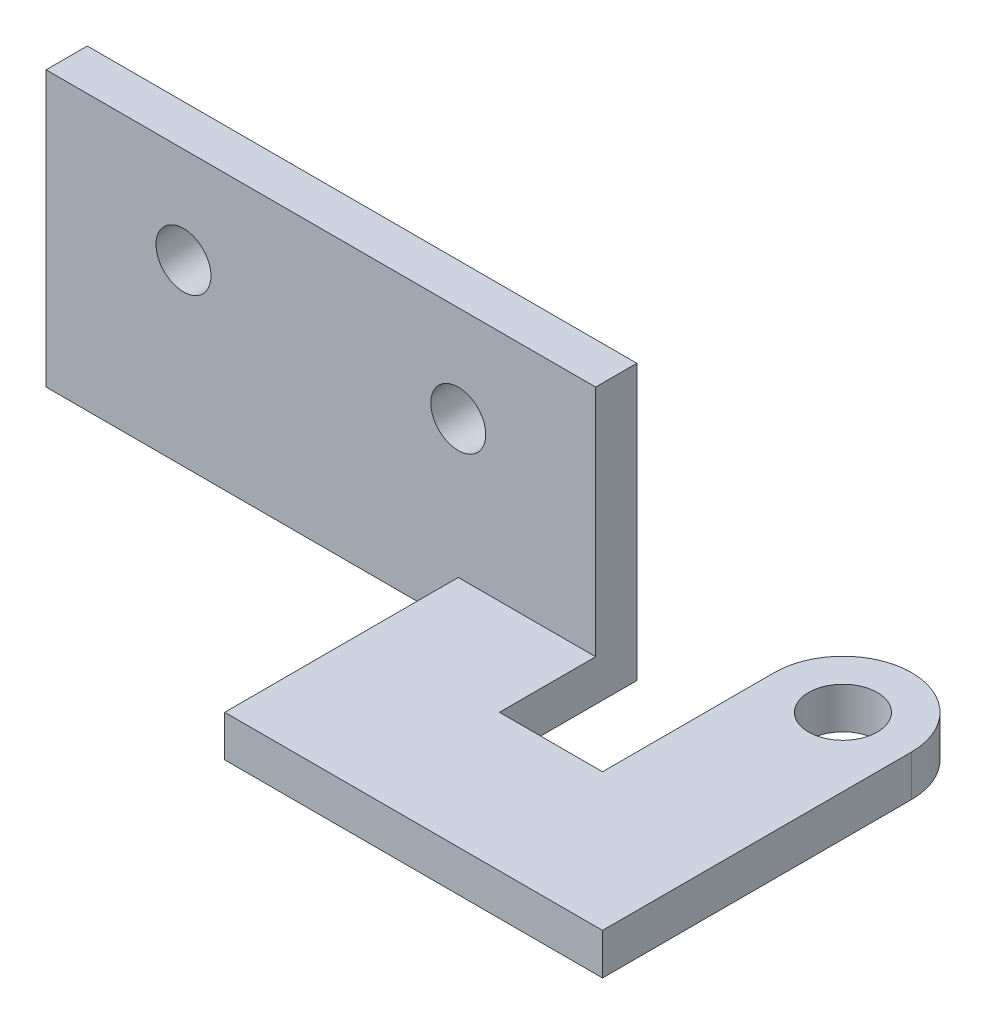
ISO-10303-21;
HEADER;
FILE_DESCRIPTION(('STEP AP214'),'2;1');
FILE_NAME('part.step','',(''),(''),'','','');
FILE_SCHEMA(('AUTOMOTIVE_DESIGN { 1 0 10303 214 1 1 1 1 }'));
ENDSEC;
DATA;
#1=APPLICATION_CONTEXT('core data for automotive mechanical design processes');
#2=APPLICATION_PROTOCOL_DEFINITION('international standard','automotive_design',2000,#1);
#3=PRODUCT_CONTEXT('',#1,'mechanical');
#4=PRODUCT('Part','Part','',(#3));
#5=PRODUCT_RELATED_PRODUCT_CATEGORY('part','',(#4));
#6=PRODUCT_DEFINITION_FORMATION('','',#4);
#7=PRODUCT_DEFINITION_CONTEXT('part definition',#1,'design');
#8=PRODUCT_DEFINITION('design','',#6,#7);
#9=PRODUCT_DEFINITION_SHAPE('','',#8);
#10=(LENGTH_UNIT() NAMED_UNIT(*) SI_UNIT(.MILLI.,.METRE.));
#11=(NAMED_UNIT(*) PLANE_ANGLE_UNIT() SI_UNIT($,.RADIAN.));
#12=(NAMED_UNIT(*) SI_UNIT($,.STERADIAN.) SOLID_ANGLE_UNIT());
#13=UNCERTAINTY_MEASURE_WITH_UNIT(LENGTH_MEASURE(1.E-05),#10,'distance_accuracy_value','');
#14=(GEOMETRIC_REPRESENTATION_CONTEXT(3) GLOBAL_UNCERTAINTY_ASSIGNED_CONTEXT((#13)) GLOBAL_UNIT_ASSIGNED_CONTEXT((#10,
#11,#12)) REPRESENTATION_CONTEXT('',''));
#15=CARTESIAN_POINT('',(0.,0.,0.));
#16=DIRECTION('',(0.,0.,1.));
#17=DIRECTION('',(1.,0.,0.));
#18=AXIS2_PLACEMENT_3D('',#15,#16,#17);
#19=CARTESIAN_POINT('',(0.,20.,3.));
#20=DIRECTION('',(0.,0.,-1.));
#21=DIRECTION('',(-1.,0.,0.));
#22=AXIS2_PLACEMENT_3D('',#19,#20,#21);
#23=PLANE('',#22);
#24=CARTESIAN_POINT('',(10.,13.,3.));
#25=DIRECTION('',(0.,0.,1.));
#26=DIRECTION('',(1.,0.,0.));
#27=AXIS2_PLACEMENT_3D('',#24,#25,#26);
#28=CIRCLE('',#27,2.);
#29=CARTESIAN_POINT('',(12.,13.,3.));
#30=VERTEX_POINT('',#29);
#31=EDGE_CURVE('E181',#30,#30,#28,.T.);
#32=ORIENTED_EDGE('',*,*,#31,.F.);
#33=EDGE_LOOP('',(#32));
#34=FACE_BOUND('',#33,.T.);
#35=DIRECTION('',(1.,0.,0.));
#36=VECTOR('',#35,1.);
#37=CARTESIAN_POINT('',(0.,0.,3.));
#38=LINE('',#37,#36);
#39=CARTESIAN_POINT('',(0.,0.,3.));
#40=VERTEX_POINT('',#39);
#41=CARTESIAN_POINT('',(30.,0.,3.));
#42=VERTEX_POINT('',#41);
#43=EDGE_CURVE('E190',#40,#42,#38,.T.);
#44=ORIENTED_EDGE('',*,*,#43,.T.);
#45=DIRECTION('',(0.,1.,0.));
#46=VECTOR('',#45,1.);
#47=CARTESIAN_POINT('',(30.,20.,3.));
#48=LINE('',#47,#46);
#49=CARTESIAN_POINT('',(30.,3.,3.));
#50=VERTEX_POINT('',#49);
#51=EDGE_CURVE('E172',#42,#50,#48,.T.);
#52=ORIENTED_EDGE('',*,*,#51,.T.);
#53=DIRECTION('',(-1.,0.,0.));
#54=VECTOR('',#53,1.);
#55=CARTESIAN_POINT('',(0.,3.,3.));
#56=LINE('',#55,#54);
#57=CARTESIAN_POINT('',(40.,3.,3.));
#58=VERTEX_POINT('',#57);
#59=EDGE_CURVE('E166',#58,#50,#56,.T.);
#60=ORIENTED_EDGE('',*,*,#59,.F.);
#61=DIRECTION('',(0.,1.,0.));
#62=VECTOR('',#61,1.);
#63=CARTESIAN_POINT('',(40.,0.,3.));
#64=LINE('',#63,#62);
#65=CARTESIAN_POINT('',(40.,20.,3.));
#66=VERTEX_POINT('',#65);
#67=EDGE_CURVE('E125',#58,#66,#64,.T.);
#68=ORIENTED_EDGE('',*,*,#67,.T.);
#69=DIRECTION('',(-1.,0.,0.));
#70=VECTOR('',#69,1.);
#71=CARTESIAN_POINT('',(0.,20.,3.));
#72=LINE('',#71,#70);
#73=CARTESIAN_POINT('',(0.,20.,3.));
#74=VERTEX_POINT('',#73);
#75=EDGE_CURVE('E194',#66,#74,#72,.T.);
#76=ORIENTED_EDGE('',*,*,#75,.T.);
#77=DIRECTION('',(0.,-1.,0.));
#78=VECTOR('',#77,1.);
#79=CARTESIAN_POINT('',(0.,0.,3.));
#80=LINE('',#79,#78);
#81=EDGE_CURVE('E187',#74,#40,#80,.T.);
#82=ORIENTED_EDGE('',*,*,#81,.T.);
#83=EDGE_LOOP('',(#44,#52,#60,#68,#76,#82));
#84=FACE_BOUND('',#83,.T.);
#85=CARTESIAN_POINT('',(30.,13.,3.));
#86=DIRECTION('',(0.,0.,1.));
#87=DIRECTION('',(1.,0.,0.));
#88=AXIS2_PLACEMENT_3D('',#85,#86,#87);
#89=CIRCLE('',#88,2.);
#90=CARTESIAN_POINT('',(32.,13.,3.));
#91=VERTEX_POINT('',#90);
#92=EDGE_CURVE('E175',#91,#91,#89,.T.);
#93=ORIENTED_EDGE('',*,*,#92,.F.);
#94=EDGE_LOOP('',(#93));
#95=FACE_BOUND('',#94,.T.);
#96=ADVANCED_FACE('F30',(#34,#84,#95),#23,.F.);
#97=CARTESIAN_POINT('',(0.,20.,0.));
#98=DIRECTION('',(0.,0.,-1.));
#99=DIRECTION('',(-1.,0.,0.));
#100=AXIS2_PLACEMENT_3D('',#97,#98,#99);
#101=PLANE('',#100);
#102=DIRECTION('',(0.,1.,0.));
#103=VECTOR('',#102,1.);
#104=CARTESIAN_POINT('',(40.,0.,0.));
#105=LINE('',#104,#103);
#106=CARTESIAN_POINT('',(40.,0.,0.));
#107=VERTEX_POINT('',#106);
#108=CARTESIAN_POINT('',(40.,20.,0.));
#109=VERTEX_POINT('',#108);
#110=EDGE_CURVE('E201',#107,#109,#105,.T.);
#111=ORIENTED_EDGE('',*,*,#110,.F.);
#112=DIRECTION('',(1.,0.,0.));
#113=VECTOR('',#112,1.);
#114=CARTESIAN_POINT('',(0.,0.,0.));
#115=LINE('',#114,#113);
#116=CARTESIAN_POINT('',(0.,0.,0.));
#117=VERTEX_POINT('',#116);
#118=EDGE_CURVE('E199',#117,#107,#115,.T.);
#119=ORIENTED_EDGE('',*,*,#118,.F.);
#120=DIRECTION('',(0.,-1.,0.));
#121=VECTOR('',#120,1.);
#122=CARTESIAN_POINT('',(0.,0.,0.));
#123=LINE('',#122,#121);
#124=CARTESIAN_POINT('',(0.,20.,0.));
#125=VERTEX_POINT('',#124);
#126=EDGE_CURVE('E184',#125,#117,#123,.T.);
#127=ORIENTED_EDGE('',*,*,#126,.F.);
#128=DIRECTION('',(-1.,0.,0.));
#129=VECTOR('',#128,1.);
#130=CARTESIAN_POINT('',(0.,20.,0.));
#131=LINE('',#130,#129);
#132=EDGE_CURVE('E191',#109,#125,#131,.T.);
#133=ORIENTED_EDGE('',*,*,#132,.F.);
#134=EDGE_LOOP('',(#111,#119,#127,#133));
#135=FACE_BOUND('',#134,.T.);
#136=CARTESIAN_POINT('',(10.,13.,0.));
#137=DIRECTION('',(0.,0.,1.));
#138=DIRECTION('',(1.,0.,0.));
#139=AXIS2_PLACEMENT_3D('',#136,#137,#138);
#140=CIRCLE('',#139,2.);
#141=CARTESIAN_POINT('',(12.,13.,0.));
#142=VERTEX_POINT('',#141);
#143=EDGE_CURVE('E178',#142,#142,#140,.T.);
#144=ORIENTED_EDGE('',*,*,#143,.T.);
#145=EDGE_LOOP('',(#144));
#146=FACE_BOUND('',#145,.T.);
#147=CARTESIAN_POINT('',(30.,13.,0.));
#148=DIRECTION('',(0.,0.,1.));
#149=DIRECTION('',(1.,0.,0.));
#150=AXIS2_PLACEMENT_3D('',#147,#148,#149);
#151=CIRCLE('',#150,2.);
#152=CARTESIAN_POINT('',(32.,13.,0.));
#153=VERTEX_POINT('',#152);
#154=EDGE_CURVE('E174',#153,#153,#151,.T.);
#155=ORIENTED_EDGE('',*,*,#154,.T.);
#156=EDGE_LOOP('',(#155));
#157=FACE_BOUND('',#156,.T.);
#158=ADVANCED_FACE('F252',(#135,#146,#157),#101,.T.);
#159=CARTESIAN_POINT('',(0.,0.,3.));
#160=DIRECTION('',(1.,0.,0.));
#161=DIRECTION('',(0.,0.,-1.));
#162=AXIS2_PLACEMENT_3D('',#159,#160,#161);
#163=PLANE('',#162);
#164=ORIENTED_EDGE('',*,*,#126,.T.);
#165=DIRECTION('',(0.,0.,-1.));
#166=VECTOR('',#165,1.);
#167=CARTESIAN_POINT('',(0.,0.,3.));
#168=LINE('',#167,#166);
#169=EDGE_CURVE('E211',#40,#117,#168,.T.);
#170=ORIENTED_EDGE('',*,*,#169,.F.);
#171=ORIENTED_EDGE('',*,*,#81,.F.);
#172=DIRECTION('',(0.,0.,-1.));
#173=VECTOR('',#172,1.);
#174=CARTESIAN_POINT('',(0.,20.,3.));
#175=LINE('',#174,#173);
#176=EDGE_CURVE('E196',#74,#125,#175,.T.);
#177=ORIENTED_EDGE('',*,*,#176,.T.);
#178=EDGE_LOOP('',(#164,#170,#171,#177));
#179=FACE_BOUND('',#178,.T.);
#180=ADVANCED_FACE('F247',(#179),#163,.F.);
#181=CARTESIAN_POINT('',(0.,0.,3.));
#182=DIRECTION('',(0.,1.,0.));
#183=DIRECTION('',(0.,0.,1.));
#184=AXIS2_PLACEMENT_3D('',#181,#182,#183);
#185=PLANE('',#184);
#186=CARTESIAN_POINT('',(52.5,0.,-2.5));
#187=DIRECTION('',(0.,1.,0.));
#188=DIRECTION('',(0.,0.,1.));
#189=AXIS2_PLACEMENT_3D('',#186,#187,#188);
#190=CIRCLE('',#189,5.);
#191=CARTESIAN_POINT('',(47.5,0.,-2.5));
#192=VERTEX_POINT('',#191);
#193=CARTESIAN_POINT('',(52.5,0.,-7.5));
#194=VERTEX_POINT('',#193);
#195=EDGE_CURVE('E214',#192,#194,#190,.F.);
#196=ORIENTED_EDGE('',*,*,#195,.T.);
#197=CARTESIAN_POINT('',(52.5,0.,-2.5));
#198=DIRECTION('',(0.,1.,0.));
#199=DIRECTION('',(0.,0.,1.));
#200=AXIS2_PLACEMENT_3D('',#197,#198,#199);
#201=CIRCLE('',#200,5.);
#202=CARTESIAN_POINT('',(57.5,0.,-2.5));
#203=VERTEX_POINT('',#202);
#204=EDGE_CURVE('E216',#194,#203,#201,.F.);
#205=ORIENTED_EDGE('',*,*,#204,.T.);
#206=DIRECTION('',(0.,0.,1.));
#207=VECTOR('',#206,1.);
#208=CARTESIAN_POINT('',(57.5,0.,-7.5));
#209=LINE('',#208,#207);
#210=CARTESIAN_POINT('',(57.5,0.,20.));
#211=VERTEX_POINT('',#210);
#212=EDGE_CURVE('E157',#203,#211,#209,.T.);
#213=ORIENTED_EDGE('',*,*,#212,.T.);
#214=DIRECTION('',(-1.,0.,0.));
#215=VECTOR('',#214,1.);
#216=CARTESIAN_POINT('',(57.5,0.,20.));
#217=LINE('',#216,#215);
#218=CARTESIAN_POINT('',(30.,0.,20.));
#219=VERTEX_POINT('',#218);
#220=EDGE_CURVE('E159',#211,#219,#217,.T.);
#221=ORIENTED_EDGE('',*,*,#220,.T.);
#222=DIRECTION('',(0.,0.,-1.));
#223=VECTOR('',#222,1.);
#224=CARTESIAN_POINT('',(30.,0.,20.));
#225=LINE('',#224,#223);
#226=EDGE_CURVE('E129',#219,#42,#225,.T.);
#227=ORIENTED_EDGE('',*,*,#226,.T.);
#228=ORIENTED_EDGE('',*,*,#43,.F.);
#229=ORIENTED_EDGE('',*,*,#169,.T.);
#230=ORIENTED_EDGE('',*,*,#118,.T.);
#231=DIRECTION('',(0.,0.,-1.));
#232=VECTOR('',#231,1.);
#233=CARTESIAN_POINT('',(40.,0.,3.));
#234=LINE('',#233,#232);
#235=CARTESIAN_POINT('',(40.,0.,10.));
#236=VERTEX_POINT('',#235);
#237=EDGE_CURVE('E209',#236,#107,#234,.T.);
#238=ORIENTED_EDGE('',*,*,#237,.F.);
#239=DIRECTION('',(1.,0.,0.));
#240=VECTOR('',#239,1.);
#241=CARTESIAN_POINT('',(40.,0.,10.));
#242=LINE('',#241,#240);
#243=CARTESIAN_POINT('',(47.5,0.,10.));
#244=VERTEX_POINT('',#243);
#245=EDGE_CURVE('E135',#236,#244,#242,.T.);
#246=ORIENTED_EDGE('',*,*,#245,.T.);
#247=DIRECTION('',(0.,0.,-1.));
#248=VECTOR('',#247,1.);
#249=CARTESIAN_POINT('',(47.5,0.,10.));
#250=LINE('',#249,#248);
#251=EDGE_CURVE('E153',#244,#192,#250,.T.);
#252=ORIENTED_EDGE('',*,*,#251,.T.);
#253=EDGE_LOOP('',(#196,#205,#213,#221,#227,#228,#229,#230,#238,#246,#252));
#254=FACE_BOUND('',#253,.T.);
#255=CARTESIAN_POINT('',(52.5,0.,-2.5));
#256=DIRECTION('',(0.,-1.,0.));
#257=DIRECTION('',(0.,0.,-1.));
#258=AXIS2_PLACEMENT_3D('',#255,#256,#257);
#259=CIRCLE('',#258,2.50000000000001);
#260=CARTESIAN_POINT('',(52.5,0.,-5.));
#261=VERTEX_POINT('',#260);
#262=EDGE_CURVE('E308',#261,#261,#259,.T.);
#263=ORIENTED_EDGE('',*,*,#262,.F.);
#264=EDGE_LOOP('',(#263));
#265=FACE_BOUND('',#264,.T.);
#266=ADVANCED_FACE('F236',(#254,#265),#185,.F.);
#267=CARTESIAN_POINT('',(40.,0.,3.));
#268=DIRECTION('',(-1.,0.,0.));
#269=DIRECTION('',(0.,0.,1.));
#270=AXIS2_PLACEMENT_3D('',#267,#268,#269);
#271=PLANE('',#270);
#272=ORIENTED_EDGE('',*,*,#110,.T.);
#273=DIRECTION('',(0.,0.,-1.));
#274=VECTOR('',#273,1.);
#275=CARTESIAN_POINT('',(40.,20.,3.));
#276=LINE('',#275,#274);
#277=EDGE_CURVE('E206',#66,#109,#276,.T.);
#278=ORIENTED_EDGE('',*,*,#277,.F.);
#279=ORIENTED_EDGE('',*,*,#67,.F.);
#280=DIRECTION('',(0.,0.,1.));
#281=VECTOR('',#280,1.);
#282=CARTESIAN_POINT('',(40.,3.,0.));
#283=LINE('',#282,#281);
#284=CARTESIAN_POINT('',(40.,3.,10.));
#285=VERTEX_POINT('',#284);
#286=EDGE_CURVE('E118',#58,#285,#283,.T.);
#287=ORIENTED_EDGE('',*,*,#286,.T.);
#288=DIRECTION('',(0.,-1.,0.));
#289=VECTOR('',#288,1.);
#290=CARTESIAN_POINT('',(40.,3.,10.));
#291=LINE('',#290,#289);
#292=EDGE_CURVE('E122',#285,#236,#291,.T.);
#293=ORIENTED_EDGE('',*,*,#292,.T.);
#294=ORIENTED_EDGE('',*,*,#237,.T.);
#295=EDGE_LOOP('',(#272,#278,#279,#287,#293,#294));
#296=FACE_BOUND('',#295,.T.);
#297=ADVANCED_FACE('F120',(#296),#271,.F.);
#298=CARTESIAN_POINT('',(0.,20.,3.));
#299=DIRECTION('',(0.,-1.,0.));
#300=DIRECTION('',(0.,0.,-1.));
#301=AXIS2_PLACEMENT_3D('',#298,#299,#300);
#302=PLANE('',#301);
#303=ORIENTED_EDGE('',*,*,#132,.T.);
#304=ORIENTED_EDGE('',*,*,#176,.F.);
#305=ORIENTED_EDGE('',*,*,#75,.F.);
#306=ORIENTED_EDGE('',*,*,#277,.T.);
#307=EDGE_LOOP('',(#303,#304,#305,#306));
#308=FACE_BOUND('',#307,.T.);
#309=ADVANCED_FACE('F256',(#308),#302,.F.);
#310=CARTESIAN_POINT('',(10.,13.,3.));
#311=DIRECTION('',(0.,0.,-1.));
#312=DIRECTION('',(-1.,0.,0.));
#313=AXIS2_PLACEMENT_3D('',#310,#311,#312);
#314=CYLINDRICAL_SURFACE('',#313,2.);
#315=ORIENTED_EDGE('',*,*,#31,.T.);
#316=EDGE_LOOP('',(#315));
#317=FACE_BOUND('',#316,.T.);
#318=ORIENTED_EDGE('',*,*,#143,.F.);
#319=EDGE_LOOP('',(#318));
#320=FACE_BOUND('',#319,.T.);
#321=ADVANCED_FACE('F258',(#317,#320),#314,.F.);
#322=CARTESIAN_POINT('',(30.,13.,3.));
#323=DIRECTION('',(0.,0.,-1.));
#324=DIRECTION('',(-1.,0.,0.));
#325=AXIS2_PLACEMENT_3D('',#322,#323,#324);
#326=CYLINDRICAL_SURFACE('',#325,2.);
#327=ORIENTED_EDGE('',*,*,#92,.T.);
#328=EDGE_LOOP('',(#327));
#329=FACE_BOUND('',#328,.T.);
#330=ORIENTED_EDGE('',*,*,#154,.F.);
#331=EDGE_LOOP('',(#330));
#332=FACE_BOUND('',#331,.T.);
#333=ADVANCED_FACE('F264',(#329,#332),#326,.F.);
#334=CARTESIAN_POINT('',(30.,3.,20.));
#335=DIRECTION('',(-1.,0.,0.));
#336=DIRECTION('',(0.,0.,1.));
#337=AXIS2_PLACEMENT_3D('',#334,#335,#336);
#338=PLANE('',#337);
#339=ORIENTED_EDGE('',*,*,#51,.F.);
#340=ORIENTED_EDGE('',*,*,#226,.F.);
#341=DIRECTION('',(0.,-1.,0.));
#342=VECTOR('',#341,1.);
#343=CARTESIAN_POINT('',(30.,3.,20.));
#344=LINE('',#343,#342);
#345=CARTESIAN_POINT('',(30.,3.,20.));
#346=VERTEX_POINT('',#345);
#347=EDGE_CURVE('E164',#346,#219,#344,.T.);
#348=ORIENTED_EDGE('',*,*,#347,.F.);
#349=DIRECTION('',(0.,0.,-1.));
#350=VECTOR('',#349,1.);
#351=CARTESIAN_POINT('',(30.,3.,20.));
#352=LINE('',#351,#350);
#353=EDGE_CURVE('E137',#346,#50,#352,.T.);
#354=ORIENTED_EDGE('',*,*,#353,.T.);
#355=EDGE_LOOP('',(#339,#340,#348,#354));
#356=FACE_BOUND('',#355,.T.);
#357=ADVANCED_FACE('F240',(#356),#338,.T.);
#358=CARTESIAN_POINT('',(40.,3.,0.));
#359=DIRECTION('',(0.,-1.,0.));
#360=DIRECTION('',(0.,0.,-1.));
#361=AXIS2_PLACEMENT_3D('',#358,#359,#360);
#362=PLANE('',#361);
#363=CARTESIAN_POINT('',(52.5,3.,-2.5));
#364=DIRECTION('',(0.,-1.,0.));
#365=DIRECTION('',(0.,0.,-1.));
#366=AXIS2_PLACEMENT_3D('',#363,#364,#365);
#367=CIRCLE('',#366,2.50000000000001);
#368=CARTESIAN_POINT('',(52.5,3.,-5.));
#369=VERTEX_POINT('',#368);
#370=EDGE_CURVE('E154',#369,#369,#367,.T.);
#371=ORIENTED_EDGE('',*,*,#370,.T.);
#372=EDGE_LOOP('',(#371));
#373=FACE_BOUND('',#372,.T.);
#374=DIRECTION('',(0.,0.,1.));
#375=VECTOR('',#374,1.);
#376=CARTESIAN_POINT('',(57.5,3.,-7.5));
#377=LINE('',#376,#375);
#378=CARTESIAN_POINT('',(57.5,3.,-2.5));
#379=VERTEX_POINT('',#378);
#380=CARTESIAN_POINT('',(57.5,3.,20.));
#381=VERTEX_POINT('',#380);
#382=EDGE_CURVE('E142',#379,#381,#377,.T.);
#383=ORIENTED_EDGE('',*,*,#382,.F.);
#384=CARTESIAN_POINT('',(52.5,3.,-2.5));
#385=DIRECTION('',(0.,-1.,0.));
#386=DIRECTION('',(0.,0.,-1.));
#387=AXIS2_PLACEMENT_3D('',#384,#385,#386);
#388=CIRCLE('',#387,5.);
#389=CARTESIAN_POINT('',(52.5,3.,-7.5));
#390=VERTEX_POINT('',#389);
#391=EDGE_CURVE('E39',#379,#390,#388,.F.);
#392=ORIENTED_EDGE('',*,*,#391,.T.);
#393=CARTESIAN_POINT('',(52.5,3.,-2.5));
#394=DIRECTION('',(0.,-1.,0.));
#395=DIRECTION('',(0.,0.,-1.));
#396=AXIS2_PLACEMENT_3D('',#393,#394,#395);
#397=CIRCLE('',#396,5.);
#398=CARTESIAN_POINT('',(47.5,3.,-2.5));
#399=VERTEX_POINT('',#398);
#400=EDGE_CURVE('E46',#390,#399,#397,.F.);
#401=ORIENTED_EDGE('',*,*,#400,.T.);
#402=DIRECTION('',(0.,0.,-1.));
#403=VECTOR('',#402,1.);
#404=CARTESIAN_POINT('',(47.5,3.,10.));
#405=LINE('',#404,#403);
#406=CARTESIAN_POINT('',(47.5,3.,10.));
#407=VERTEX_POINT('',#406);
#408=EDGE_CURVE('E140',#407,#399,#405,.T.);
#409=ORIENTED_EDGE('',*,*,#408,.F.);
#410=DIRECTION('',(1.,0.,0.));
#411=VECTOR('',#410,1.);
#412=CARTESIAN_POINT('',(40.,3.,10.));
#413=LINE('',#412,#411);
#414=EDGE_CURVE('E128',#285,#407,#413,.T.);
#415=ORIENTED_EDGE('',*,*,#414,.F.);
#416=ORIENTED_EDGE('',*,*,#286,.F.);
#417=ORIENTED_EDGE('',*,*,#59,.T.);
#418=ORIENTED_EDGE('',*,*,#353,.F.);
#419=DIRECTION('',(-1.,0.,0.));
#420=VECTOR('',#419,1.);
#421=CARTESIAN_POINT('',(57.5,3.,20.));
#422=LINE('',#421,#420);
#423=EDGE_CURVE('E147',#381,#346,#422,.T.);
#424=ORIENTED_EDGE('',*,*,#423,.F.);
#425=EDGE_LOOP('',(#383,#392,#401,#409,#415,#416,#417,#418,#424));
#426=FACE_BOUND('',#425,.T.);
#427=ADVANCED_FACE('F139',(#373,#426),#362,.F.);
#428=CARTESIAN_POINT('',(57.5,3.,20.));
#429=DIRECTION('',(0.,0.,1.));
#430=DIRECTION('',(1.,0.,0.));
#431=AXIS2_PLACEMENT_3D('',#428,#429,#430);
#432=PLANE('',#431);
#433=ORIENTED_EDGE('',*,*,#220,.F.);
#434=DIRECTION('',(0.,-1.,0.));
#435=VECTOR('',#434,1.);
#436=CARTESIAN_POINT('',(57.5,3.,20.));
#437=LINE('',#436,#435);
#438=EDGE_CURVE('E167',#381,#211,#437,.T.);
#439=ORIENTED_EDGE('',*,*,#438,.F.);
#440=ORIENTED_EDGE('',*,*,#423,.T.);
#441=ORIENTED_EDGE('',*,*,#347,.T.);
#442=EDGE_LOOP('',(#433,#439,#440,#441));
#443=FACE_BOUND('',#442,.T.);
#444=ADVANCED_FACE('F233',(#443),#432,.T.);
#445=CARTESIAN_POINT('',(57.5,3.,-7.5));
#446=DIRECTION('',(1.,0.,0.));
#447=DIRECTION('',(0.,0.,-1.));
#448=AXIS2_PLACEMENT_3D('',#445,#446,#447);
#449=PLANE('',#448);
#450=ORIENTED_EDGE('',*,*,#212,.F.);
#451=DIRECTION('',(0.,-1.,0.));
#452=VECTOR('',#451,1.);
#453=CARTESIAN_POINT('',(57.5,3.,-2.5));
#454=LINE('',#453,#452);
#455=EDGE_CURVE('E218',#203,#379,#454,.F.);
#456=ORIENTED_EDGE('',*,*,#455,.T.);
#457=ORIENTED_EDGE('',*,*,#382,.T.);
#458=ORIENTED_EDGE('',*,*,#438,.T.);
#459=EDGE_LOOP('',(#450,#456,#457,#458));
#460=FACE_BOUND('',#459,.T.);
#461=ADVANCED_FACE('F225',(#460),#449,.T.);
#462=CARTESIAN_POINT('',(47.5,3.,10.));
#463=DIRECTION('',(-1.,0.,0.));
#464=DIRECTION('',(0.,0.,1.));
#465=AXIS2_PLACEMENT_3D('',#462,#463,#464);
#466=PLANE('',#465);
#467=ORIENTED_EDGE('',*,*,#408,.T.);
#468=DIRECTION('',(0.,-1.,0.));
#469=VECTOR('',#468,1.);
#470=CARTESIAN_POINT('',(47.5,3.,-2.5));
#471=LINE('',#470,#469);
#472=EDGE_CURVE('E11',#399,#192,#471,.T.);
#473=ORIENTED_EDGE('',*,*,#472,.T.);
#474=ORIENTED_EDGE('',*,*,#251,.F.);
#475=DIRECTION('',(0.,-1.,0.));
#476=VECTOR('',#475,1.);
#477=CARTESIAN_POINT('',(47.5,3.,10.));
#478=LINE('',#477,#476);
#479=EDGE_CURVE('E136',#407,#244,#478,.T.);
#480=ORIENTED_EDGE('',*,*,#479,.F.);
#481=EDGE_LOOP('',(#467,#473,#474,#480));
#482=FACE_BOUND('',#481,.T.);
#483=ADVANCED_FACE('F283',(#482),#466,.T.);
#484=CARTESIAN_POINT('',(40.,3.,10.));
#485=DIRECTION('',(0.,0.,-1.));
#486=DIRECTION('',(-1.,0.,0.));
#487=AXIS2_PLACEMENT_3D('',#484,#485,#486);
#488=PLANE('',#487);
#489=ORIENTED_EDGE('',*,*,#245,.F.);
#490=ORIENTED_EDGE('',*,*,#292,.F.);
#491=ORIENTED_EDGE('',*,*,#414,.T.);
#492=ORIENTED_EDGE('',*,*,#479,.T.);
#493=EDGE_LOOP('',(#489,#490,#491,#492));
#494=FACE_BOUND('',#493,.T.);
#495=ADVANCED_FACE('F133',(#494),#488,.T.);
#496=CARTESIAN_POINT('',(52.5,3.,-2.5));
#497=DIRECTION('',(0.,-1.,0.));
#498=DIRECTION('',(0.,0.,-1.));
#499=AXIS2_PLACEMENT_3D('',#496,#497,#498);
#500=CYLINDRICAL_SURFACE('',#499,2.50000000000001);
#501=ORIENTED_EDGE('',*,*,#370,.F.);
#502=EDGE_LOOP('',(#501));
#503=FACE_BOUND('',#502,.T.);
#504=ORIENTED_EDGE('',*,*,#262,.T.);
#505=EDGE_LOOP('',(#504));
#506=FACE_BOUND('',#505,.T.);
#507=ADVANCED_FACE('F282',(#503,#506),#500,.F.);
#508=CARTESIAN_POINT('',(52.5,3.,-2.5));
#509=DIRECTION('',(0.,-1.,0.));
#510=DIRECTION('',(0.,0.,-1.));
#511=AXIS2_PLACEMENT_3D('',#508,#509,#510);
#512=CYLINDRICAL_SURFACE('',#511,5.);
#513=ORIENTED_EDGE('',*,*,#472,.F.);
#514=ORIENTED_EDGE('',*,*,#400,.F.);
#515=DIRECTION('',(0.,-1.,0.));
#516=VECTOR('',#515,1.);
#517=CARTESIAN_POINT('',(52.5,3.,-7.5));
#518=LINE('',#517,#516);
#519=EDGE_CURVE('E34',#194,#390,#518,.F.);
#520=ORIENTED_EDGE('',*,*,#519,.F.);
#521=ORIENTED_EDGE('',*,*,#195,.F.);
#522=EDGE_LOOP('',(#513,#514,#520,#521));
#523=FACE_BOUND('',#522,.T.);
#524=ADVANCED_FACE('F32',(#523),#512,.T.);
#525=CARTESIAN_POINT('',(52.5,3.,-2.5));
#526=DIRECTION('',(0.,-1.,0.));
#527=DIRECTION('',(0.,0.,-1.));
#528=AXIS2_PLACEMENT_3D('',#525,#526,#527);
#529=CYLINDRICAL_SURFACE('',#528,5.);
#530=ORIENTED_EDGE('',*,*,#391,.F.);
#531=ORIENTED_EDGE('',*,*,#455,.F.);
#532=ORIENTED_EDGE('',*,*,#204,.F.);
#533=ORIENTED_EDGE('',*,*,#519,.T.);
#534=EDGE_LOOP('',(#530,#531,#532,#533));
#535=FACE_BOUND('',#534,.T.);
#536=ADVANCED_FACE('F301',(#535),#529,.T.);
#537=CLOSED_SHELL('',(#96,#158,#180,#266,#297,#309,#321,#333,#357,#427,#444,#461,#483,#495,#507,
#524,#536));
#538=MANIFOLD_SOLID_BREP('B2',#537);
#539=ADVANCED_BREP_SHAPE_REPRESENTATION('',(#18,#538),#14);
#540=SHAPE_DEFINITION_REPRESENTATION(#9,#539);
ENDSEC;
END-ISO-10303-21;
